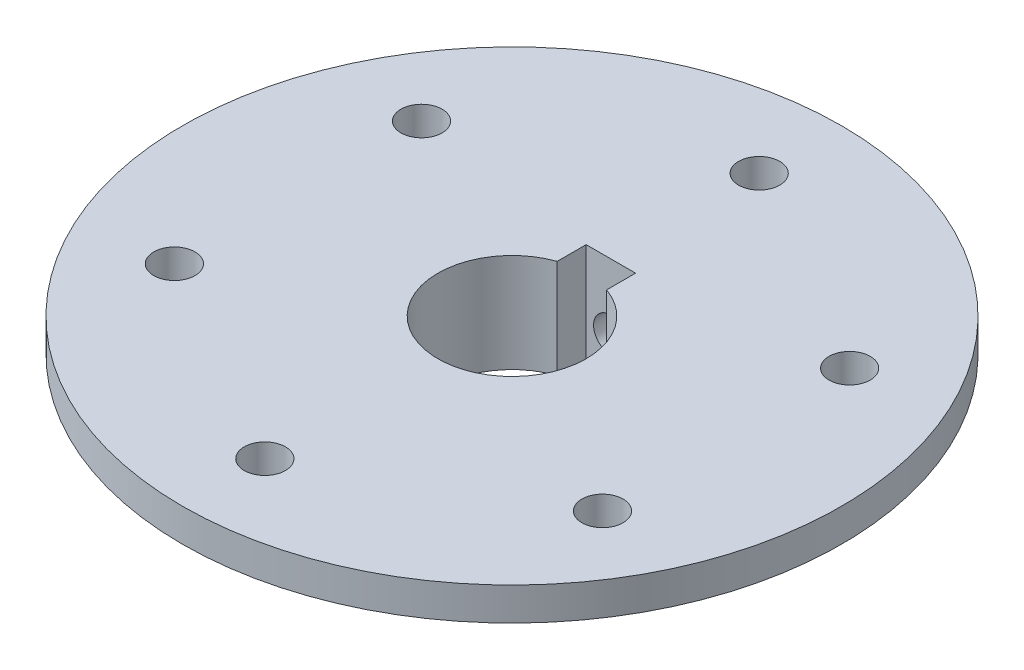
ISO-10303-21;
HEADER;
FILE_DESCRIPTION(('STEP AP214'),'2;1');
FILE_NAME('part.step','',(''),(''),'','','');
FILE_SCHEMA(('AUTOMOTIVE_DESIGN { 1 0 10303 214 1 1 1 1 }'));
ENDSEC;
DATA;
#1=APPLICATION_CONTEXT('core data for automotive mechanical design processes');
#2=APPLICATION_PROTOCOL_DEFINITION('international standard','automotive_design',2000,#1);
#3=PRODUCT_CONTEXT('',#1,'mechanical');
#4=PRODUCT('Part','Part','',(#3));
#5=PRODUCT_RELATED_PRODUCT_CATEGORY('part','',(#4));
#6=PRODUCT_DEFINITION_FORMATION('','',#4);
#7=PRODUCT_DEFINITION_CONTEXT('part definition',#1,'design');
#8=PRODUCT_DEFINITION('design','',#6,#7);
#9=PRODUCT_DEFINITION_SHAPE('','',#8);
#10=(LENGTH_UNIT() NAMED_UNIT(*) SI_UNIT(.MILLI.,.METRE.));
#11=(NAMED_UNIT(*) PLANE_ANGLE_UNIT() SI_UNIT($,.RADIAN.));
#12=(NAMED_UNIT(*) SI_UNIT($,.STERADIAN.) SOLID_ANGLE_UNIT());
#13=UNCERTAINTY_MEASURE_WITH_UNIT(LENGTH_MEASURE(1.E-05),#10,'distance_accuracy_value','');
#14=(GEOMETRIC_REPRESENTATION_CONTEXT(3) GLOBAL_UNCERTAINTY_ASSIGNED_CONTEXT((#13)) GLOBAL_UNIT_ASSIGNED_CONTEXT((#10,
#11,#12)) REPRESENTATION_CONTEXT('',''));
#15=CARTESIAN_POINT('',(0.,0.,0.));
#16=DIRECTION('',(0.,0.,1.));
#17=DIRECTION('',(1.,0.,0.));
#18=AXIS2_PLACEMENT_3D('',#15,#16,#17);
#19=CARTESIAN_POINT('',(0.,0.999999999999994,0.));
#20=DIRECTION('',(0.,1.,0.));
#21=DIRECTION('',(0.,0.,1.));
#22=AXIS2_PLACEMENT_3D('',#19,#20,#21);
#23=CONICAL_SURFACE('',#22,19.,0.78539816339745);
#24=CARTESIAN_POINT('',(0.,0.,0.));
#25=DIRECTION('',(0.,1.,0.));
#26=DIRECTION('',(0.,0.,1.));
#27=AXIS2_PLACEMENT_3D('',#24,#25,#26);
#28=CIRCLE('',#27,18.);
#29=CARTESIAN_POINT('',(0.,0.,18.));
#30=VERTEX_POINT('',#29);
#31=EDGE_CURVE('E150',#30,#30,#28,.T.);
#32=ORIENTED_EDGE('',*,*,#31,.T.);
#33=EDGE_LOOP('',(#32));
#34=FACE_BOUND('',#33,.T.);
#35=CARTESIAN_POINT('',(0.,0.999999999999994,0.));
#36=DIRECTION('',(0.,-1.,0.));
#37=DIRECTION('',(0.,0.,-1.));
#38=AXIS2_PLACEMENT_3D('',#35,#36,#37);
#39=CIRCLE('',#38,19.);
#40=CARTESIAN_POINT('',(0.,0.999999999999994,-19.));
#41=VERTEX_POINT('',#40);
#42=EDGE_CURVE('E102',#41,#41,#39,.F.);
#43=ORIENTED_EDGE('',*,*,#42,.F.);
#44=EDGE_LOOP('',(#43));
#45=FACE_BOUND('',#44,.T.);
#46=ADVANCED_FACE('F17',(#34,#45),#23,.T.);
#47=CARTESIAN_POINT('',(0.,8.,0.));
#48=DIRECTION('',(0.,-1.,0.));
#49=DIRECTION('',(0.,0.,-1.));
#50=AXIS2_PLACEMENT_3D('',#47,#48,#49);
#51=CYLINDRICAL_SURFACE('',#50,19.);
#52=CARTESIAN_POINT('',(0.,8.,0.));
#53=DIRECTION('',(0.,-1.,0.));
#54=DIRECTION('',(0.,0.,-1.));
#55=AXIS2_PLACEMENT_3D('',#52,#53,#54);
#56=CIRCLE('',#55,19.);
#57=CARTESIAN_POINT('',(0.,8.,-19.));
#58=VERTEX_POINT('',#57);
#59=EDGE_CURVE('E148',#58,#58,#56,.F.);
#60=ORIENTED_EDGE('',*,*,#59,.F.);
#61=EDGE_LOOP('',(#60));
#62=FACE_BOUND('',#61,.T.);
#63=CARTESIAN_POINT('',(2.1,4.,-18.8835907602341));
#64=CARTESIAN_POINT('',(2.09999494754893,4.11757082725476,-18.8835922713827));
#65=CARTESIAN_POINT('',(2.09009324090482,4.23521757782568,-18.8847006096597));
#66=CARTESIAN_POINT('',(2.05074569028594,4.46724451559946,-18.8890131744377));
#67=CARTESIAN_POINT('',(2.02127874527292,4.58162103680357,-18.8922196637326));
#68=CARTESIAN_POINT('',(1.94367292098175,4.80371585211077,-18.9003610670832));
#69=CARTESIAN_POINT('',(1.89554558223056,4.91143821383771,-18.9052949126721));
#70=CARTESIAN_POINT('',(1.78201068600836,5.11725099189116,-18.9163335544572));
#71=CARTESIAN_POINT('',(1.71660695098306,5.2153435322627,-18.9224380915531));
#72=CARTESIAN_POINT('',(1.57007360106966,5.39956203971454,-18.9351599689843));
#73=CARTESIAN_POINT('',(1.48888464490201,5.48564067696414,-18.9417791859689));
#74=CARTESIAN_POINT('',(1.31318834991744,5.64299911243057,-18.9547692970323));
#75=CARTESIAN_POINT('',(1.2186774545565,5.71427494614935,-18.9611401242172));
#76=CARTESIAN_POINT('',(1.018703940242,5.84017643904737,-18.972935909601));
#77=CARTESIAN_POINT('',(0.913209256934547,5.89475140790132,-18.97835796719));
#78=CARTESIAN_POINT('',(0.694557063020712,5.98533718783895,-18.9876147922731));
#79=CARTESIAN_POINT('',(0.581408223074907,6.02136861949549,-18.9914513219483));
#80=CARTESIAN_POINT('',(0.389701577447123,6.0650143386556,-18.996157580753));
#81=CARTESIAN_POINT('',(0.312362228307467,6.07811565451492,-18.9975916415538));
#82=CARTESIAN_POINT('',(0.156693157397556,6.09561014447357,-18.9995133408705));
#83=CARTESIAN_POINT('',(0.0783634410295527,6.10000336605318,-19.0000009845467));
#84=CARTESIAN_POINT('',(-0.117573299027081,6.0999949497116,-18.9999985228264));
#85=CARTESIAN_POINT('',(-0.235222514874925,6.09009284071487,-18.998897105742));
#86=CARTESIAN_POINT('',(-0.467254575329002,6.05074354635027,-18.9946092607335));
#87=CARTESIAN_POINT('',(-0.581633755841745,6.0212752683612,-18.9914205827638));
#88=CARTESIAN_POINT('',(-0.803734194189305,5.94366554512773,-18.9833178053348));
#89=CARTESIAN_POINT('',(-0.911459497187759,5.89553557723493,-18.9784047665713));
#90=CARTESIAN_POINT('',(-1.11727720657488,5.78199448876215,-18.967401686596));
#91=CARTESIAN_POINT('',(-1.21537174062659,5.71658719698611,-18.9613119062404));
#92=CARTESIAN_POINT('',(-1.3995880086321,5.57005024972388,-18.9486074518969));
#93=CARTESIAN_POINT('',(-1.48566304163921,5.48886204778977,-18.9419908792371));
#94=CARTESIAN_POINT('',(-1.64301451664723,5.31316877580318,-18.9289924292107));
#95=CARTESIAN_POINT('',(-1.71428698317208,5.21866013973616,-18.9226106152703));
#96=CARTESIAN_POINT('',(-1.84018495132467,5.01868860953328,-18.9107837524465));
#97=CARTESIAN_POINT('',(-1.89475914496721,4.91319326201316,-18.9053416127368));
#98=CARTESIAN_POINT('',(-1.98534330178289,4.69453963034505,-18.8960446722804));
#99=CARTESIAN_POINT('',(-2.02137389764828,4.58139002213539,-18.8921881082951));
#100=CARTESIAN_POINT('',(-2.06501722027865,4.38968561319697,-18.8874559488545));
#101=CARTESIAN_POINT('',(-2.07811745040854,4.31234946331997,-18.8860135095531));
#102=CARTESIAN_POINT('',(-2.0956104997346,4.15668678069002,-18.8840804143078));
#103=CARTESIAN_POINT('',(-2.10000336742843,4.07836025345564,-18.8835897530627));
#104=CARTESIAN_POINT('',(-2.09999494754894,3.88242917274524,-18.8835922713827));
#105=CARTESIAN_POINT('',(-2.09009324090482,3.76478242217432,-18.8847006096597));
#106=CARTESIAN_POINT('',(-2.05074569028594,3.53275548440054,-18.8890131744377));
#107=CARTESIAN_POINT('',(-2.02127874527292,3.41837896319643,-18.8922196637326));
#108=CARTESIAN_POINT('',(-1.94367292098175,3.19628414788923,-18.9003610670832));
#109=CARTESIAN_POINT('',(-1.89554558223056,3.08856178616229,-18.9052949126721));
#110=CARTESIAN_POINT('',(-1.78201068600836,2.88274900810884,-18.9163335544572));
#111=CARTESIAN_POINT('',(-1.71660695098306,2.7846564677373,-18.9224380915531));
#112=CARTESIAN_POINT('',(-1.57007360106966,2.60043796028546,-18.9351599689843));
#113=CARTESIAN_POINT('',(-1.48888464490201,2.51435932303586,-18.9417791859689));
#114=CARTESIAN_POINT('',(-1.31318834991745,2.35700088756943,-18.9547692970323));
#115=CARTESIAN_POINT('',(-1.2186774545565,2.28572505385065,-18.9611401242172));
#116=CARTESIAN_POINT('',(-1.018703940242,2.15982356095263,-18.972935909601));
#117=CARTESIAN_POINT('',(-0.913209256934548,2.10524859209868,-18.97835796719));
#118=CARTESIAN_POINT('',(-0.694557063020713,2.01466281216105,-18.9876147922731));
#119=CARTESIAN_POINT('',(-0.581408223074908,1.97863138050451,-18.9914513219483));
#120=CARTESIAN_POINT('',(-0.389701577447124,1.9349856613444,-18.996157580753));
#121=CARTESIAN_POINT('',(-0.312362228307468,1.92188434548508,-18.9975916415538));
#122=CARTESIAN_POINT('',(-0.156693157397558,1.90438985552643,-18.9995133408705));
#123=CARTESIAN_POINT('',(-0.0783634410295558,1.89999663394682,-19.0000009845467));
#124=CARTESIAN_POINT('',(0.117573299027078,1.9000050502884,-18.9999985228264));
#125=CARTESIAN_POINT('',(0.235222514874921,1.90990715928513,-18.998897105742));
#126=CARTESIAN_POINT('',(0.467254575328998,1.94925645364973,-18.9946092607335));
#127=CARTESIAN_POINT('',(0.581633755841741,1.9787247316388,-18.9914205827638));
#128=CARTESIAN_POINT('',(0.803734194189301,2.05633445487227,-18.9833178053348));
#129=CARTESIAN_POINT('',(0.911459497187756,2.10446442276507,-18.9784047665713));
#130=CARTESIAN_POINT('',(1.11727720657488,2.21800551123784,-18.967401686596));
#131=CARTESIAN_POINT('',(1.21537174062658,2.28341280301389,-18.9613119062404));
#132=CARTESIAN_POINT('',(1.3995880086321,2.42994975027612,-18.9486074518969));
#133=CARTESIAN_POINT('',(1.48566304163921,2.51113795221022,-18.9419908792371));
#134=CARTESIAN_POINT('',(1.64301451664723,2.68683122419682,-18.9289924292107));
#135=CARTESIAN_POINT('',(1.71428698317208,2.78133986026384,-18.9226106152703));
#136=CARTESIAN_POINT('',(1.84018495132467,2.98131139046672,-18.9107837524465));
#137=CARTESIAN_POINT('',(1.89475914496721,3.08680673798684,-18.9053416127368));
#138=CARTESIAN_POINT('',(1.98534330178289,3.30546036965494,-18.8960446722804));
#139=CARTESIAN_POINT('',(2.02137389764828,3.4186099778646,-18.8921881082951));
#140=CARTESIAN_POINT('',(2.06501722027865,3.61031438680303,-18.8874559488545));
#141=CARTESIAN_POINT('',(2.07811745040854,3.68765053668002,-18.8860135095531));
#142=CARTESIAN_POINT('',(2.0956104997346,3.84331321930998,-18.8840804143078));
#143=CARTESIAN_POINT('',(2.10000336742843,3.92163974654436,-18.8835897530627));
#144=CARTESIAN_POINT('',(2.1,4.,-18.8835907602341));
#145=B_SPLINE_CURVE_WITH_KNOTS('',3,(#63,#64,#65,#66,#67,#68,#69,#70,#71,#72,#73,#74,#75,#76,
#77,#78,#79,#80,#81,#82,#83,#84,#85,#86,#87,#88,#89,#90,#91,#92,#93,#94,#95,#96,#97,#98,#99,
#100,#101,#102,#103,#104,#105,#106,#107,#108,#109,#110,#111,#112,#113,#114,#115,#116,#117,#118,
#119,#120,#121,#122,#123,#124,#125,#126,#127,#128,#129,#130,#131,#132,#133,#134,#135,#136,#137,
#138,#139,#140,#141,#142,#143,#144),.UNSPECIFIED.,.T.,.F.,(4,2,2,2,2,2,2,2,2,2,2,2,2,2,2,2,2,2,
2,2,2,2,2,2,2,2,2,2,2,2,2,2,2,2,2,2,2,2,2,2,4),(0.,0.352426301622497,0.705233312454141,
1.05782247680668,1.4103336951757,1.76419666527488,2.11815428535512,2.47317581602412,
2.82780170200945,3.06270257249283,3.29760216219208,3.65003589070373,4.0028501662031,
4.35544779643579,4.70796735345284,5.06182060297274,5.41576876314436,5.77079380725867,
6.12542297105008,6.36031430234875,6.59520432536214,6.94763062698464,7.30043763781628,
7.65302680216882,8.00553802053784,8.35940099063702,8.71335861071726,9.06838014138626,
9.42300602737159,9.65790689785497,9.89280648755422,10.2452402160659,10.5980544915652,
10.9506521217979,11.303171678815,11.6570249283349,12.0109730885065,12.3659981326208,
12.7206272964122,12.9555186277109,13.1904086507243),.UNSPECIFIED.);
#146=CARTESIAN_POINT('',(2.1,4.,-18.8835907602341));
#147=VERTEX_POINT('',#146);
#148=EDGE_CURVE('E20',#147,#147,#145,.T.);
#149=ORIENTED_EDGE('',*,*,#148,.T.);
#150=EDGE_LOOP('',(#149));
#151=FACE_BOUND('',#150,.T.);
#152=ORIENTED_EDGE('',*,*,#42,.T.);
#153=EDGE_LOOP('',(#152));
#154=FACE_BOUND('',#153,.T.);
#155=ADVANCED_FACE('F157',(#62,#151,#154),#51,.T.);
#156=CARTESIAN_POINT('',(0.,4.,-12.));
#157=DIRECTION('',(0.,0.,1.));
#158=DIRECTION('',(1.,0.,0.));
#159=AXIS2_PLACEMENT_3D('',#156,#157,#158);
#160=CYLINDRICAL_SURFACE('',#159,2.1);
#161=ORIENTED_EDGE('',*,*,#148,.F.);
#162=EDGE_LOOP('',(#161));
#163=FACE_BOUND('',#162,.T.);
#164=CARTESIAN_POINT('',(0.,4.,-12.));
#165=DIRECTION('',(0.,0.,1.));
#166=DIRECTION('',(1.,0.,0.));
#167=AXIS2_PLACEMENT_3D('',#164,#165,#166);
#168=CIRCLE('',#167,2.1);
#169=CARTESIAN_POINT('',(2.1,4.,-12.));
#170=VERTEX_POINT('',#169);
#171=EDGE_CURVE('E92',#170,#170,#168,.T.);
#172=ORIENTED_EDGE('',*,*,#171,.T.);
#173=EDGE_LOOP('',(#172));
#174=FACE_BOUND('',#173,.T.);
#175=ADVANCED_FACE('F160',(#163,#174),#160,.F.);
#176=CARTESIAN_POINT('',(0.,0.,0.));
#177=DIRECTION('',(0.,1.,0.));
#178=DIRECTION('',(0.,0.,1.));
#179=AXIS2_PLACEMENT_3D('',#176,#177,#178);
#180=PLANE('',#179);
#181=DIRECTION('',(0.,0.,-1.));
#182=VECTOR('',#181,1.);
#183=CARTESIAN_POINT('',(3.,0.,-12.));
#184=LINE('',#183,#182);
#185=CARTESIAN_POINT('',(3.,0.,-8.48528137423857));
#186=VERTEX_POINT('',#185);
#187=CARTESIAN_POINT('',(3.,0.,-12.));
#188=VERTEX_POINT('',#187);
#189=EDGE_CURVE('E64',#186,#188,#184,.T.);
#190=ORIENTED_EDGE('',*,*,#189,.T.);
#191=DIRECTION('',(-1.,0.,0.));
#192=VECTOR('',#191,1.);
#193=CARTESIAN_POINT('',(-3.,0.,-12.));
#194=LINE('',#193,#192);
#195=CARTESIAN_POINT('',(-3.,0.,-12.));
#196=VERTEX_POINT('',#195);
#197=EDGE_CURVE('E91',#188,#196,#194,.T.);
#198=ORIENTED_EDGE('',*,*,#197,.T.);
#199=DIRECTION('',(0.,0.,1.));
#200=VECTOR('',#199,1.);
#201=CARTESIAN_POINT('',(-3.,0.,-12.));
#202=LINE('',#201,#200);
#203=CARTESIAN_POINT('',(-3.,0.,-8.48528137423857));
#204=VERTEX_POINT('',#203);
#205=EDGE_CURVE('E58',#196,#204,#202,.T.);
#206=ORIENTED_EDGE('',*,*,#205,.T.);
#207=CARTESIAN_POINT('',(0.,0.,0.));
#208=DIRECTION('',(0.,-1.,0.));
#209=DIRECTION('',(0.,0.,-1.));
#210=AXIS2_PLACEMENT_3D('',#207,#208,#209);
#211=CIRCLE('',#210,9.);
#212=EDGE_CURVE('E60',#204,#186,#211,.F.);
#213=ORIENTED_EDGE('',*,*,#212,.T.);
#214=EDGE_LOOP('',(#190,#198,#206,#213));
#215=FACE_BOUND('',#214,.T.);
#216=ORIENTED_EDGE('',*,*,#31,.F.);
#217=EDGE_LOOP('',(#216));
#218=FACE_BOUND('',#217,.T.);
#219=ADVANCED_FACE('F62',(#215,#218),#180,.F.);
#220=CARTESIAN_POINT('',(0.,8.,0.));
#221=DIRECTION('',(0.,-1.,0.));
#222=DIRECTION('',(0.,0.,-1.));
#223=AXIS2_PLACEMENT_3D('',#220,#221,#222);
#224=PLANE('',#223);
#225=CARTESIAN_POINT('',(0.,8.,0.));
#226=DIRECTION('',(0.,-1.,0.));
#227=DIRECTION('',(0.,0.,-1.));
#228=AXIS2_PLACEMENT_3D('',#225,#226,#227);
#229=CIRCLE('',#228,40.);
#230=CARTESIAN_POINT('',(0.,8.,-40.));
#231=VERTEX_POINT('',#230);
#232=EDGE_CURVE('E126',#231,#231,#229,.F.);
#233=ORIENTED_EDGE('',*,*,#232,.F.);
#234=EDGE_LOOP('',(#233));
#235=FACE_BOUND('',#234,.T.);
#236=ORIENTED_EDGE('',*,*,#59,.T.);
#237=EDGE_LOOP('',(#236));
#238=FACE_BOUND('',#237,.T.);
#239=CARTESIAN_POINT('',(0.,8.,-30.));
#240=DIRECTION('',(0.,1.,0.));
#241=DIRECTION('',(0.,0.,1.));
#242=AXIS2_PLACEMENT_3D('',#239,#240,#241);
#243=CIRCLE('',#242,2.5);
#244=CARTESIAN_POINT('',(0.,8.,-27.5));
#245=VERTEX_POINT('',#244);
#246=EDGE_CURVE('E77',#245,#245,#243,.T.);
#247=ORIENTED_EDGE('',*,*,#246,.T.);
#248=EDGE_LOOP('',(#247));
#249=FACE_BOUND('',#248,.T.);
#250=CARTESIAN_POINT('',(25.9807621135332,8.,-14.9999999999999));
#251=DIRECTION('',(0.,1.,0.));
#252=DIRECTION('',(0.,0.,1.));
#253=AXIS2_PLACEMENT_3D('',#250,#251,#252);
#254=CIRCLE('',#253,2.5);
#255=CARTESIAN_POINT('',(25.9807621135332,8.,-12.4999999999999));
#256=VERTEX_POINT('',#255);
#257=EDGE_CURVE('E133',#256,#256,#254,.T.);
#258=ORIENTED_EDGE('',*,*,#257,.T.);
#259=EDGE_LOOP('',(#258));
#260=FACE_BOUND('',#259,.T.);
#261=CARTESIAN_POINT('',(25.9807621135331,8.,15.0000000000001));
#262=DIRECTION('',(0.,1.,0.));
#263=DIRECTION('',(0.,0.,1.));
#264=AXIS2_PLACEMENT_3D('',#261,#262,#263);
#265=CIRCLE('',#264,2.5);
#266=CARTESIAN_POINT('',(25.9807621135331,8.,17.5000000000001));
#267=VERTEX_POINT('',#266);
#268=EDGE_CURVE('E136',#267,#267,#265,.T.);
#269=ORIENTED_EDGE('',*,*,#268,.T.);
#270=EDGE_LOOP('',(#269));
#271=FACE_BOUND('',#270,.T.);
#272=CARTESIAN_POINT('',(0.,8.,30.));
#273=DIRECTION('',(0.,1.,0.));
#274=DIRECTION('',(0.,0.,1.));
#275=AXIS2_PLACEMENT_3D('',#272,#273,#274);
#276=CIRCLE('',#275,2.5);
#277=CARTESIAN_POINT('',(0.,8.,32.5));
#278=VERTEX_POINT('',#277);
#279=EDGE_CURVE('E139',#278,#278,#276,.T.);
#280=ORIENTED_EDGE('',*,*,#279,.T.);
#281=EDGE_LOOP('',(#280));
#282=FACE_BOUND('',#281,.T.);
#283=CARTESIAN_POINT('',(-25.9807621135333,8.,14.9999999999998));
#284=DIRECTION('',(0.,1.,0.));
#285=DIRECTION('',(0.,0.,1.));
#286=AXIS2_PLACEMENT_3D('',#283,#284,#285);
#287=CIRCLE('',#286,2.5);
#288=CARTESIAN_POINT('',(-25.9807621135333,8.,17.4999999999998));
#289=VERTEX_POINT('',#288);
#290=EDGE_CURVE('E142',#289,#289,#287,.T.);
#291=ORIENTED_EDGE('',*,*,#290,.T.);
#292=EDGE_LOOP('',(#291));
#293=FACE_BOUND('',#292,.T.);
#294=CARTESIAN_POINT('',(-25.980762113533,8.,-15.0000000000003));
#295=DIRECTION('',(0.,1.,0.));
#296=DIRECTION('',(0.,0.,1.));
#297=AXIS2_PLACEMENT_3D('',#294,#295,#296);
#298=CIRCLE('',#297,2.5);
#299=CARTESIAN_POINT('',(-25.980762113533,8.,-12.5000000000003));
#300=VERTEX_POINT('',#299);
#301=EDGE_CURVE('E145',#300,#300,#298,.T.);
#302=ORIENTED_EDGE('',*,*,#301,.T.);
#303=EDGE_LOOP('',(#302));
#304=FACE_BOUND('',#303,.T.);
#305=ADVANCED_FACE('F206',(#235,#238,#249,#260,#271,#282,#293,#304),#224,.T.);
#306=CARTESIAN_POINT('',(-25.980762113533,12.,-15.0000000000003));
#307=DIRECTION('',(0.,1.,0.));
#308=DIRECTION('',(0.,0.,1.));
#309=AXIS2_PLACEMENT_3D('',#306,#307,#308);
#310=CYLINDRICAL_SURFACE('',#309,2.5);
#311=CARTESIAN_POINT('',(-25.980762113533,12.,-15.0000000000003));
#312=DIRECTION('',(0.,1.,0.));
#313=DIRECTION('',(0.,0.,1.));
#314=AXIS2_PLACEMENT_3D('',#311,#312,#313);
#315=CIRCLE('',#314,2.5);
#316=CARTESIAN_POINT('',(-25.980762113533,12.,-12.5000000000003));
#317=VERTEX_POINT('',#316);
#318=EDGE_CURVE('E123',#317,#317,#315,.F.);
#319=ORIENTED_EDGE('',*,*,#318,.F.);
#320=EDGE_LOOP('',(#319));
#321=FACE_BOUND('',#320,.T.);
#322=ORIENTED_EDGE('',*,*,#301,.F.);
#323=EDGE_LOOP('',(#322));
#324=FACE_BOUND('',#323,.T.);
#325=ADVANCED_FACE('F202',(#321,#324),#310,.F.);
#326=CARTESIAN_POINT('',(-25.9807621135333,12.,14.9999999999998));
#327=DIRECTION('',(0.,1.,0.));
#328=DIRECTION('',(0.,0.,1.));
#329=AXIS2_PLACEMENT_3D('',#326,#327,#328);
#330=CYLINDRICAL_SURFACE('',#329,2.5);
#331=CARTESIAN_POINT('',(-25.9807621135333,12.,14.9999999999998));
#332=DIRECTION('',(0.,1.,0.));
#333=DIRECTION('',(0.,0.,1.));
#334=AXIS2_PLACEMENT_3D('',#331,#332,#333);
#335=CIRCLE('',#334,2.5);
#336=CARTESIAN_POINT('',(-25.9807621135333,12.,17.4999999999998));
#337=VERTEX_POINT('',#336);
#338=EDGE_CURVE('E120',#337,#337,#335,.F.);
#339=ORIENTED_EDGE('',*,*,#338,.F.);
#340=EDGE_LOOP('',(#339));
#341=FACE_BOUND('',#340,.T.);
#342=ORIENTED_EDGE('',*,*,#290,.F.);
#343=EDGE_LOOP('',(#342));
#344=FACE_BOUND('',#343,.T.);
#345=ADVANCED_FACE('F205',(#341,#344),#330,.F.);
#346=CARTESIAN_POINT('',(0.,12.,30.));
#347=DIRECTION('',(0.,1.,0.));
#348=DIRECTION('',(0.,0.,1.));
#349=AXIS2_PLACEMENT_3D('',#346,#347,#348);
#350=CYLINDRICAL_SURFACE('',#349,2.5);
#351=CARTESIAN_POINT('',(0.,12.,30.));
#352=DIRECTION('',(0.,1.,0.));
#353=DIRECTION('',(0.,0.,1.));
#354=AXIS2_PLACEMENT_3D('',#351,#352,#353);
#355=CIRCLE('',#354,2.5);
#356=CARTESIAN_POINT('',(0.,12.,32.5));
#357=VERTEX_POINT('',#356);
#358=EDGE_CURVE('E117',#357,#357,#355,.F.);
#359=ORIENTED_EDGE('',*,*,#358,.F.);
#360=EDGE_LOOP('',(#359));
#361=FACE_BOUND('',#360,.T.);
#362=ORIENTED_EDGE('',*,*,#279,.F.);
#363=EDGE_LOOP('',(#362));
#364=FACE_BOUND('',#363,.T.);
#365=ADVANCED_FACE('F240',(#361,#364),#350,.F.);
#366=CARTESIAN_POINT('',(25.9807621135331,12.,15.0000000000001));
#367=DIRECTION('',(0.,1.,0.));
#368=DIRECTION('',(0.,0.,1.));
#369=AXIS2_PLACEMENT_3D('',#366,#367,#368);
#370=CYLINDRICAL_SURFACE('',#369,2.5);
#371=CARTESIAN_POINT('',(25.9807621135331,12.,15.0000000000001));
#372=DIRECTION('',(0.,1.,0.));
#373=DIRECTION('',(0.,0.,1.));
#374=AXIS2_PLACEMENT_3D('',#371,#372,#373);
#375=CIRCLE('',#374,2.5);
#376=CARTESIAN_POINT('',(25.9807621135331,12.,17.5000000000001));
#377=VERTEX_POINT('',#376);
#378=EDGE_CURVE('E114',#377,#377,#375,.F.);
#379=ORIENTED_EDGE('',*,*,#378,.F.);
#380=EDGE_LOOP('',(#379));
#381=FACE_BOUND('',#380,.T.);
#382=ORIENTED_EDGE('',*,*,#268,.F.);
#383=EDGE_LOOP('',(#382));
#384=FACE_BOUND('',#383,.T.);
#385=ADVANCED_FACE('F245',(#381,#384),#370,.F.);
#386=CARTESIAN_POINT('',(25.9807621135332,12.,-14.9999999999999));
#387=DIRECTION('',(0.,1.,0.));
#388=DIRECTION('',(0.,0.,1.));
#389=AXIS2_PLACEMENT_3D('',#386,#387,#388);
#390=CYLINDRICAL_SURFACE('',#389,2.5);
#391=CARTESIAN_POINT('',(25.9807621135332,12.,-14.9999999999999));
#392=DIRECTION('',(0.,1.,0.));
#393=DIRECTION('',(0.,0.,1.));
#394=AXIS2_PLACEMENT_3D('',#391,#392,#393);
#395=CIRCLE('',#394,2.5);
#396=CARTESIAN_POINT('',(25.9807621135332,12.,-12.4999999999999));
#397=VERTEX_POINT('',#396);
#398=EDGE_CURVE('E111',#397,#397,#395,.F.);
#399=ORIENTED_EDGE('',*,*,#398,.F.);
#400=EDGE_LOOP('',(#399));
#401=FACE_BOUND('',#400,.T.);
#402=ORIENTED_EDGE('',*,*,#257,.F.);
#403=EDGE_LOOP('',(#402));
#404=FACE_BOUND('',#403,.T.);
#405=ADVANCED_FACE('F251',(#401,#404),#390,.F.);
#406=CARTESIAN_POINT('',(0.,12.,-30.));
#407=DIRECTION('',(0.,1.,0.));
#408=DIRECTION('',(0.,0.,1.));
#409=AXIS2_PLACEMENT_3D('',#406,#407,#408);
#410=CYLINDRICAL_SURFACE('',#409,2.5);
#411=CARTESIAN_POINT('',(0.,12.,-30.));
#412=DIRECTION('',(0.,1.,0.));
#413=DIRECTION('',(0.,0.,1.));
#414=AXIS2_PLACEMENT_3D('',#411,#412,#413);
#415=CIRCLE('',#414,2.5);
#416=CARTESIAN_POINT('',(0.,12.,-27.5));
#417=VERTEX_POINT('',#416);
#418=EDGE_CURVE('E108',#417,#417,#415,.F.);
#419=ORIENTED_EDGE('',*,*,#418,.F.);
#420=EDGE_LOOP('',(#419));
#421=FACE_BOUND('',#420,.T.);
#422=ORIENTED_EDGE('',*,*,#246,.F.);
#423=EDGE_LOOP('',(#422));
#424=FACE_BOUND('',#423,.T.);
#425=ADVANCED_FACE('F255',(#421,#424),#410,.F.);
#426=CARTESIAN_POINT('',(3.,0.,-12.));
#427=DIRECTION('',(1.,0.,0.));
#428=DIRECTION('',(0.,0.,-1.));
#429=AXIS2_PLACEMENT_3D('',#426,#427,#428);
#430=PLANE('',#429);
#431=DIRECTION('',(0.,0.,1.));
#432=VECTOR('',#431,1.);
#433=CARTESIAN_POINT('',(3.,12.,0.));
#434=LINE('',#433,#432);
#435=CARTESIAN_POINT('',(3.,12.,-12.));
#436=VERTEX_POINT('',#435);
#437=CARTESIAN_POINT('',(3.,12.,-8.48528137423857));
#438=VERTEX_POINT('',#437);
#439=EDGE_CURVE('E107',#436,#438,#434,.T.);
#440=ORIENTED_EDGE('',*,*,#439,.F.);
#441=DIRECTION('',(0.,1.,0.));
#442=VECTOR('',#441,1.);
#443=CARTESIAN_POINT('',(3.,0.,-12.));
#444=LINE('',#443,#442);
#445=EDGE_CURVE('E75',#436,#188,#444,.F.);
#446=ORIENTED_EDGE('',*,*,#445,.T.);
#447=ORIENTED_EDGE('',*,*,#189,.F.);
#448=DIRECTION('',(0.,-1.,0.));
#449=VECTOR('',#448,1.);
#450=CARTESIAN_POINT('',(3.,12.,-8.48528137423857));
#451=LINE('',#450,#449);
#452=EDGE_CURVE('E69',#186,#438,#451,.F.);
#453=ORIENTED_EDGE('',*,*,#452,.T.);
#454=EDGE_LOOP('',(#440,#446,#447,#453));
#455=FACE_BOUND('',#454,.T.);
#456=ADVANCED_FACE('F72',(#455),#430,.F.);
#457=CARTESIAN_POINT('',(0.,12.,0.));
#458=DIRECTION('',(0.,-1.,0.));
#459=DIRECTION('',(0.,0.,-1.));
#460=AXIS2_PLACEMENT_3D('',#457,#458,#459);
#461=CYLINDRICAL_SURFACE('',#460,9.);
#462=ORIENTED_EDGE('',*,*,#212,.F.);
#463=DIRECTION('',(0.,1.,0.));
#464=VECTOR('',#463,1.);
#465=CARTESIAN_POINT('',(-3.,0.,-8.48528137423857));
#466=LINE('',#465,#464);
#467=CARTESIAN_POINT('',(-3.,12.,-8.48528137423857));
#468=VERTEX_POINT('',#467);
#469=EDGE_CURVE('E84',#204,#468,#466,.T.);
#470=ORIENTED_EDGE('',*,*,#469,.T.);
#471=CARTESIAN_POINT('',(0.,12.,0.));
#472=DIRECTION('',(0.,-1.,0.));
#473=DIRECTION('',(0.,0.,-1.));
#474=AXIS2_PLACEMENT_3D('',#471,#472,#473);
#475=CIRCLE('',#474,9.);
#476=EDGE_CURVE('E81',#438,#468,#475,.T.);
#477=ORIENTED_EDGE('',*,*,#476,.F.);
#478=ORIENTED_EDGE('',*,*,#452,.F.);
#479=EDGE_LOOP('',(#462,#470,#477,#478));
#480=FACE_BOUND('',#479,.T.);
#481=ADVANCED_FACE('F79',(#480),#461,.F.);
#482=CARTESIAN_POINT('',(-3.,0.,-12.));
#483=DIRECTION('',(-1.,0.,0.));
#484=DIRECTION('',(0.,0.,1.));
#485=AXIS2_PLACEMENT_3D('',#482,#483,#484);
#486=PLANE('',#485);
#487=ORIENTED_EDGE('',*,*,#205,.F.);
#488=DIRECTION('',(0.,1.,0.));
#489=VECTOR('',#488,1.);
#490=CARTESIAN_POINT('',(-3.,0.,-12.));
#491=LINE('',#490,#489);
#492=CARTESIAN_POINT('',(-3.,12.,-12.));
#493=VERTEX_POINT('',#492);
#494=EDGE_CURVE('E38',#196,#493,#491,.T.);
#495=ORIENTED_EDGE('',*,*,#494,.T.);
#496=DIRECTION('',(0.,0.,1.));
#497=VECTOR('',#496,1.);
#498=CARTESIAN_POINT('',(-3.,12.,0.));
#499=LINE('',#498,#497);
#500=EDGE_CURVE('E106',#468,#493,#499,.F.);
#501=ORIENTED_EDGE('',*,*,#500,.F.);
#502=ORIENTED_EDGE('',*,*,#469,.F.);
#503=EDGE_LOOP('',(#487,#495,#501,#502));
#504=FACE_BOUND('',#503,.T.);
#505=ADVANCED_FACE('F168',(#504),#486,.F.);
#506=CARTESIAN_POINT('',(-3.,0.,-12.));
#507=DIRECTION('',(0.,0.,-1.));
#508=DIRECTION('',(-1.,0.,0.));
#509=AXIS2_PLACEMENT_3D('',#506,#507,#508);
#510=PLANE('',#509);
#511=ORIENTED_EDGE('',*,*,#494,.F.);
#512=ORIENTED_EDGE('',*,*,#197,.F.);
#513=ORIENTED_EDGE('',*,*,#445,.F.);
#514=DIRECTION('',(1.,0.,0.));
#515=VECTOR('',#514,1.);
#516=CARTESIAN_POINT('',(0.,12.,-12.));
#517=LINE('',#516,#515);
#518=EDGE_CURVE('E29',#493,#436,#517,.T.);
#519=ORIENTED_EDGE('',*,*,#518,.F.);
#520=EDGE_LOOP('',(#511,#512,#513,#519));
#521=FACE_BOUND('',#520,.T.);
#522=ORIENTED_EDGE('',*,*,#171,.F.);
#523=EDGE_LOOP('',(#522));
#524=FACE_BOUND('',#523,.T.);
#525=ADVANCED_FACE('F165',(#521,#524),#510,.F.);
#526=CARTESIAN_POINT('',(0.,12.,0.));
#527=DIRECTION('',(0.,-1.,0.));
#528=DIRECTION('',(0.,0.,-1.));
#529=AXIS2_PLACEMENT_3D('',#526,#527,#528);
#530=CYLINDRICAL_SURFACE('',#529,40.);
#531=ORIENTED_EDGE('',*,*,#232,.T.);
#532=EDGE_LOOP('',(#531));
#533=FACE_BOUND('',#532,.T.);
#534=CARTESIAN_POINT('',(0.,12.,0.));
#535=DIRECTION('',(0.,-1.,0.));
#536=DIRECTION('',(0.,0.,-1.));
#537=AXIS2_PLACEMENT_3D('',#534,#535,#536);
#538=CIRCLE('',#537,40.);
#539=CARTESIAN_POINT('',(0.,12.,-40.));
#540=VERTEX_POINT('',#539);
#541=EDGE_CURVE('E11',#540,#540,#538,.F.);
#542=ORIENTED_EDGE('',*,*,#541,.F.);
#543=EDGE_LOOP('',(#542));
#544=FACE_BOUND('',#543,.T.);
#545=ADVANCED_FACE('F167',(#533,#544),#530,.T.);
#546=CARTESIAN_POINT('',(0.,12.,0.));
#547=DIRECTION('',(0.,1.,0.));
#548=DIRECTION('',(0.,0.,1.));
#549=AXIS2_PLACEMENT_3D('',#546,#547,#548);
#550=PLANE('',#549);
#551=ORIENTED_EDGE('',*,*,#541,.T.);
#552=EDGE_LOOP('',(#551));
#553=FACE_BOUND('',#552,.T.);
#554=ORIENTED_EDGE('',*,*,#500,.T.);
#555=ORIENTED_EDGE('',*,*,#518,.T.);
#556=ORIENTED_EDGE('',*,*,#439,.T.);
#557=ORIENTED_EDGE('',*,*,#476,.T.);
#558=EDGE_LOOP('',(#554,#555,#556,#557));
#559=FACE_BOUND('',#558,.T.);
#560=ORIENTED_EDGE('',*,*,#418,.T.);
#561=EDGE_LOOP('',(#560));
#562=FACE_BOUND('',#561,.T.);
#563=ORIENTED_EDGE('',*,*,#398,.T.);
#564=EDGE_LOOP('',(#563));
#565=FACE_BOUND('',#564,.T.);
#566=ORIENTED_EDGE('',*,*,#378,.T.);
#567=EDGE_LOOP('',(#566));
#568=FACE_BOUND('',#567,.T.);
#569=ORIENTED_EDGE('',*,*,#358,.T.);
#570=EDGE_LOOP('',(#569));
#571=FACE_BOUND('',#570,.T.);
#572=ORIENTED_EDGE('',*,*,#338,.T.);
#573=EDGE_LOOP('',(#572));
#574=FACE_BOUND('',#573,.T.);
#575=ORIENTED_EDGE('',*,*,#318,.T.);
#576=EDGE_LOOP('',(#575));
#577=FACE_BOUND('',#576,.T.);
#578=ADVANCED_FACE('F176',(#553,#559,#562,#565,#568,#571,#574,#577),#550,.T.);
#579=CLOSED_SHELL('',(#46,#155,#175,#219,#305,#325,#345,#365,#385,#405,#425,#456,#481,#505,#525,
#545,#578));
#580=MANIFOLD_SOLID_BREP('B1',#579);
#581=ADVANCED_BREP_SHAPE_REPRESENTATION('',(#18,#580),#14);
#582=SHAPE_DEFINITION_REPRESENTATION(#9,#581);
ENDSEC;
END-ISO-10303-21;
